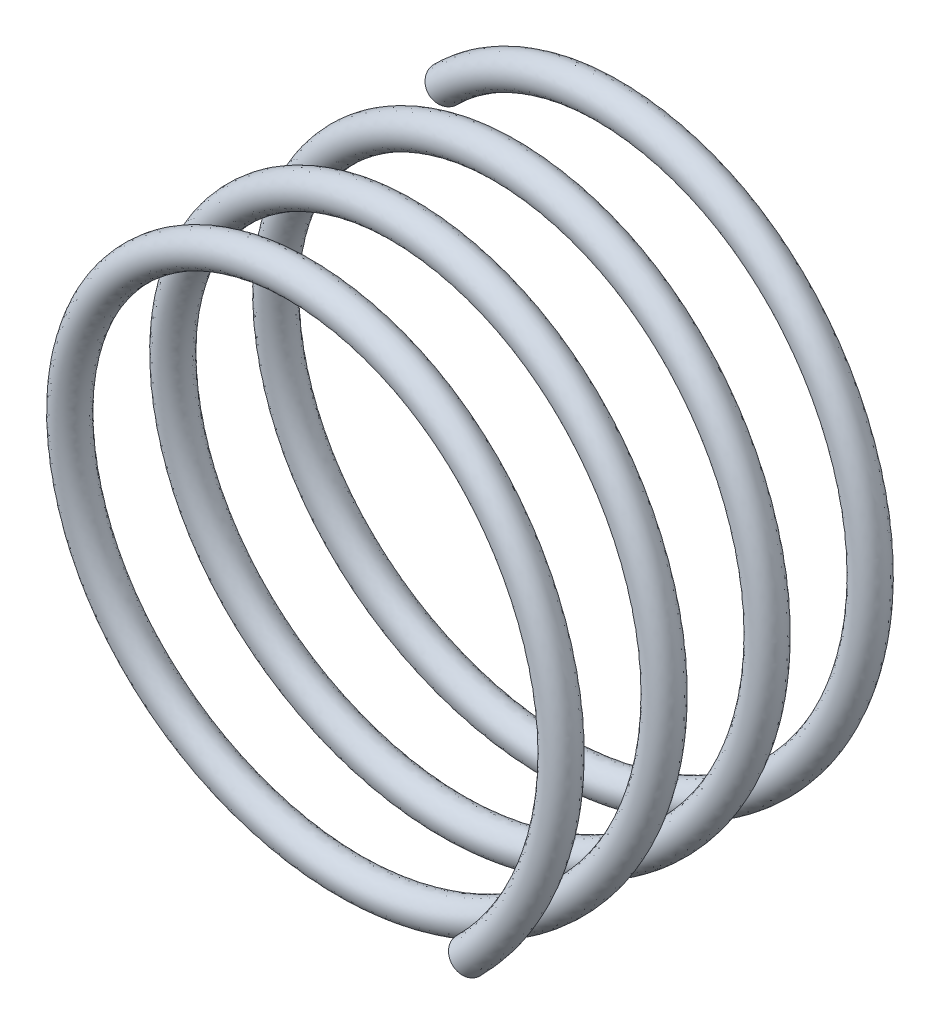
ISO-10303-21;
HEADER;
FILE_DESCRIPTION(('STEP AP214'),'2;1');
FILE_NAME('part.step','',(''),(''),'','','');
FILE_SCHEMA(('AUTOMOTIVE_DESIGN { 1 0 10303 214 1 1 1 1 }'));
ENDSEC;
DATA;
#1=APPLICATION_CONTEXT('core data for automotive mechanical design processes');
#2=APPLICATION_PROTOCOL_DEFINITION('international standard','automotive_design',2000,#1);
#3=PRODUCT_CONTEXT('',#1,'mechanical');
#4=PRODUCT('Part','Part','',(#3));
#5=PRODUCT_RELATED_PRODUCT_CATEGORY('part','',(#4));
#6=PRODUCT_DEFINITION_FORMATION('','',#4);
#7=PRODUCT_DEFINITION_CONTEXT('part definition',#1,'design');
#8=PRODUCT_DEFINITION('design','',#6,#7);
#9=PRODUCT_DEFINITION_SHAPE('','',#8);
#10=(LENGTH_UNIT() NAMED_UNIT(*) SI_UNIT(.MILLI.,.METRE.));
#11=(NAMED_UNIT(*) PLANE_ANGLE_UNIT() SI_UNIT($,.RADIAN.));
#12=(NAMED_UNIT(*) SI_UNIT($,.STERADIAN.) SOLID_ANGLE_UNIT());
#13=UNCERTAINTY_MEASURE_WITH_UNIT(LENGTH_MEASURE(1.E-05),#10,'distance_accuracy_value','');
#14=(GEOMETRIC_REPRESENTATION_CONTEXT(3) GLOBAL_UNCERTAINTY_ASSIGNED_CONTEXT((#13)) GLOBAL_UNIT_ASSIGNED_CONTEXT((#10,
#11,#12)) REPRESENTATION_CONTEXT('',''));
#15=CARTESIAN_POINT('',(0.,0.,0.));
#16=DIRECTION('',(0.,0.,1.));
#17=DIRECTION('',(1.,0.,0.));
#18=AXIS2_PLACEMENT_3D('',#15,#16,#17);
#19=CARTESIAN_POINT('',(2.32288080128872,-2.32310555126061,4.37240380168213));
#20=DIRECTION('',(-0.705785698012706,-0.705785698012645,0.061099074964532));
#21=DIRECTION('',(0.707106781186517,-0.707106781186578,0.));
#22=AXIS2_PLACEMENT_3D('',#19,#20,#21);
#23=PLANE('',#22);
#24=CARTESIAN_POINT('',(2.32288080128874,-2.32310555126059,4.37240380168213));
#25=DIRECTION('',(-0.7057856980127,-0.705785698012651,0.061099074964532));
#26=DIRECTION('',(0.707106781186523,-0.707106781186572,0.));
#27=AXIS2_PLACEMENT_3D('',#24,#25,#26);
#28=CIRCLE('',#27,0.2);
#29=CARTESIAN_POINT('',(2.46430215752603,-2.46452690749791,4.37240380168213));
#30=VERTEX_POINT('',#29);
#31=EDGE_CURVE('E36',#30,#30,#28,.T.);
#32=ORIENTED_EDGE('',*,*,#31,.T.);
#33=EDGE_LOOP('',(#32));
#34=FACE_BOUND('',#33,.T.);
#35=ADVANCED_FACE('F26',(#34),#23,.T.);
#36=CARTESIAN_POINT('',(-2.32288080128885,2.32310555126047,-0.00259619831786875));
#37=DIRECTION('',(0.705785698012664,0.705785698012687,0.061099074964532));
#38=DIRECTION('',(-0.707106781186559,0.707106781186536,0.));
#39=AXIS2_PLACEMENT_3D('',#36,#37,#38);
#40=PLANE('',#39);
#41=CARTESIAN_POINT('',(-2.32288080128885,2.32310555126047,-0.00259619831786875));
#42=DIRECTION('',(0.705785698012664,0.705785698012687,0.061099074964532));
#43=DIRECTION('',(-0.707106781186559,0.707106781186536,0.));
#44=AXIS2_PLACEMENT_3D('',#41,#42,#43);
#45=CIRCLE('',#44,0.2);
#46=CARTESIAN_POINT('',(-2.46430215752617,2.46452690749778,-0.00259619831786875));
#47=VERTEX_POINT('',#46);
#48=EDGE_CURVE('E11',#47,#47,#45,.T.);
#49=ORIENTED_EDGE('',*,*,#48,.F.);
#50=EDGE_LOOP('',(#49));
#51=FACE_BOUND('',#50,.T.);
#52=ADVANCED_FACE('F44',(#51),#40,.F.);
#53=CARTESIAN_POINT('',(2.46430215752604,-2.4645269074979,4.37240380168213));
#54=CARTESIAN_POINT('',(3.88719743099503,-1.04176139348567,4.26823713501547));
#55=CARTESIAN_POINT('',(3.3664939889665,0.901884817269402,4.1640704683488));
#56=CARTESIAN_POINT('',(2.84579054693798,2.84553102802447,4.05990380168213));
#57=CARTESIAN_POINT('',(0.902191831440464,3.3664117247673,3.95573713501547));
#58=CARTESIAN_POINT('',(-1.04140688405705,3.88729242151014,3.8515704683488));
#59=CARTESIAN_POINT('',(-2.46430215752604,2.4645269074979,3.74740380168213));
#60=CARTESIAN_POINT('',(-3.88719743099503,1.04176139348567,3.64323713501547));
#61=CARTESIAN_POINT('',(-3.3664939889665,-0.901884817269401,3.5390704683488));
#62=CARTESIAN_POINT('',(-2.84579054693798,-2.84553102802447,3.43490380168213));
#63=CARTESIAN_POINT('',(-0.902191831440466,-3.3664117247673,3.33073713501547));
#64=CARTESIAN_POINT('',(1.04140688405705,-3.88729242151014,3.2265704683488));
#65=CARTESIAN_POINT('',(2.46430215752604,-2.4645269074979,3.12240380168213));
#66=CARTESIAN_POINT('',(3.88719743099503,-1.04176139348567,3.01823713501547));
#67=CARTESIAN_POINT('',(3.3664939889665,0.901884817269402,2.9140704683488));
#68=CARTESIAN_POINT('',(2.84579054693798,2.84553102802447,2.80990380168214));
#69=CARTESIAN_POINT('',(0.902191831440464,3.3664117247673,2.70573713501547));
#70=CARTESIAN_POINT('',(-1.04140688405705,3.88729242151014,2.6015704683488));
#71=CARTESIAN_POINT('',(-2.46430215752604,2.4645269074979,2.49740380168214));
#72=CARTESIAN_POINT('',(-3.88719743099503,1.04176139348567,2.39323713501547));
#73=CARTESIAN_POINT('',(-3.3664939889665,-0.901884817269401,2.2890704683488));
#74=CARTESIAN_POINT('',(-2.84579054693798,-2.84553102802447,2.18490380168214));
#75=CARTESIAN_POINT('',(-0.902191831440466,-3.3664117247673,2.08073713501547));
#76=CARTESIAN_POINT('',(1.04140688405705,-3.88729242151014,1.9765704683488));
#77=CARTESIAN_POINT('',(2.46430215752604,-2.4645269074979,1.87240380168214));
#78=CARTESIAN_POINT('',(3.88719743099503,-1.04176139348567,1.76823713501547));
#79=CARTESIAN_POINT('',(3.3664939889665,0.901884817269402,1.6640704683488));
#80=CARTESIAN_POINT('',(2.84579054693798,2.84553102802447,1.55990380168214));
#81=CARTESIAN_POINT('',(0.902191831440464,3.3664117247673,1.45573713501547));
#82=CARTESIAN_POINT('',(-1.04140688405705,3.88729242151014,1.35157046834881));
#83=CARTESIAN_POINT('',(-2.46430215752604,2.4645269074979,1.24740380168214));
#84=CARTESIAN_POINT('',(-3.88719743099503,1.04176139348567,1.14323713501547));
#85=CARTESIAN_POINT('',(-3.3664939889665,-0.901884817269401,1.03907046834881));
#86=CARTESIAN_POINT('',(-2.84579054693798,-2.84553102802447,0.934903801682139));
#87=CARTESIAN_POINT('',(-0.902191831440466,-3.3664117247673,0.830737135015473));
#88=CARTESIAN_POINT('',(1.04140688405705,-3.88729242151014,0.726570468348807));
#89=CARTESIAN_POINT('',(2.46430215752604,-2.4645269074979,0.62240380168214));
#90=CARTESIAN_POINT('',(3.88719743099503,-1.04176139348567,0.518237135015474));
#91=CARTESIAN_POINT('',(3.3664939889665,0.901884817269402,0.414070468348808));
#92=CARTESIAN_POINT('',(2.84579054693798,2.84553102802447,0.309903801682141));
#93=CARTESIAN_POINT('',(0.902191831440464,3.3664117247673,0.205737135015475));
#94=CARTESIAN_POINT('',(-1.04140688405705,3.88729242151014,0.101570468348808));
#95=CARTESIAN_POINT('',(-2.46430215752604,2.4645269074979,-0.00259619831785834));
#96=CARTESIAN_POINT('',(-3.88719743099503,1.04176139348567,-0.106762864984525));
#97=CARTESIAN_POINT('',(-3.3664939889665,-0.901884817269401,-0.210929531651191));
#98=CARTESIAN_POINT('',(-2.84579054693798,-2.84553102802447,-0.315096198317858));
#99=CARTESIAN_POINT('',(-0.902191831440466,-3.3664117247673,-0.419262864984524));
#100=CARTESIAN_POINT('',(1.04140688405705,-3.88729242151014,-0.523429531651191));
#101=CARTESIAN_POINT('',(2.46430215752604,-2.4645269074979,-0.627596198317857));
#102=CARTESIAN_POINT('',(2.4815835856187,-2.44724547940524,4.77165648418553));
#103=CARTESIAN_POINT('',(3.89450142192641,-1.01450252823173,4.66748981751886));
#104=CARTESIAN_POINT('',(3.36016854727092,0.925491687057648,4.56332315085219));
#105=CARTESIAN_POINT('',(2.82583567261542,2.86548590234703,4.45915648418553));
#106=CARTESIAN_POINT('',(0.878584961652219,3.37273716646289,4.35498981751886));
#107=CARTESIAN_POINT('',(-1.06866574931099,3.87998843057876,4.25082315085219));
#108=CARTESIAN_POINT('',(-2.4815835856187,2.44724547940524,4.14665648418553));
#109=CARTESIAN_POINT('',(-3.89450142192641,1.01450252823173,4.04248981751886));
#110=CARTESIAN_POINT('',(-3.36016854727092,-0.925491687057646,3.93832315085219));
#111=CARTESIAN_POINT('',(-2.82583567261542,-2.86548590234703,3.83415648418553));
#112=CARTESIAN_POINT('',(-0.878584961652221,-3.37273716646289,3.72998981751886));
#113=CARTESIAN_POINT('',(1.06866574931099,-3.87998843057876,3.6258231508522));
#114=CARTESIAN_POINT('',(2.4815835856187,-2.44724547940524,3.52165648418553));
#115=CARTESIAN_POINT('',(3.89450142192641,-1.01450252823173,3.41748981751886));
#116=CARTESIAN_POINT('',(3.36016854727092,0.925491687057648,3.3133231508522));
#117=CARTESIAN_POINT('',(2.82583567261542,2.86548590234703,3.20915648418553));
#118=CARTESIAN_POINT('',(0.878584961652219,3.37273716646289,3.10498981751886));
#119=CARTESIAN_POINT('',(-1.06866574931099,3.87998843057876,3.0008231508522));
#120=CARTESIAN_POINT('',(-2.4815835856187,2.44724547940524,2.89665648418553));
#121=CARTESIAN_POINT('',(-3.89450142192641,1.01450252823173,2.79248981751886));
#122=CARTESIAN_POINT('',(-3.36016854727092,-0.925491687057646,2.6883231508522));
#123=CARTESIAN_POINT('',(-2.82583567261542,-2.86548590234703,2.58415648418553));
#124=CARTESIAN_POINT('',(-0.878584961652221,-3.37273716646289,2.47998981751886));
#125=CARTESIAN_POINT('',(1.06866574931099,-3.87998843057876,2.3758231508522));
#126=CARTESIAN_POINT('',(2.4815835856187,-2.44724547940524,2.27165648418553));
#127=CARTESIAN_POINT('',(3.89450142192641,-1.01450252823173,2.16748981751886));
#128=CARTESIAN_POINT('',(3.36016854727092,0.925491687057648,2.0633231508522));
#129=CARTESIAN_POINT('',(2.82583567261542,2.86548590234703,1.95915648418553));
#130=CARTESIAN_POINT('',(0.878584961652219,3.37273716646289,1.85498981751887));
#131=CARTESIAN_POINT('',(-1.06866574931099,3.87998843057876,1.7508231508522));
#132=CARTESIAN_POINT('',(-2.4815835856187,2.44724547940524,1.64665648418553));
#133=CARTESIAN_POINT('',(-3.89450142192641,1.01450252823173,1.54248981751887));
#134=CARTESIAN_POINT('',(-3.36016854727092,-0.925491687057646,1.4383231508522));
#135=CARTESIAN_POINT('',(-2.82583567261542,-2.86548590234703,1.33415648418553));
#136=CARTESIAN_POINT('',(-0.878584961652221,-3.37273716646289,1.22998981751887));
#137=CARTESIAN_POINT('',(1.06866574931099,-3.87998843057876,1.1258231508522));
#138=CARTESIAN_POINT('',(2.4815835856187,-2.44724547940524,1.02165648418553));
#139=CARTESIAN_POINT('',(3.89450142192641,-1.01450252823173,0.917489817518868));
#140=CARTESIAN_POINT('',(3.36016854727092,0.925491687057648,0.813323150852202));
#141=CARTESIAN_POINT('',(2.82583567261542,2.86548590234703,0.709156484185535));
#142=CARTESIAN_POINT('',(0.878584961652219,3.37273716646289,0.604989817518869));
#143=CARTESIAN_POINT('',(-1.06866574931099,3.87998843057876,0.500823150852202));
#144=CARTESIAN_POINT('',(-2.4815835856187,2.44724547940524,0.396656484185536));
#145=CARTESIAN_POINT('',(-3.89450142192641,1.01450252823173,0.292489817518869));
#146=CARTESIAN_POINT('',(-3.36016854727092,-0.925491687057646,0.188323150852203));
#147=CARTESIAN_POINT('',(-2.82583567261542,-2.86548590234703,0.0841564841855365));
#148=CARTESIAN_POINT('',(-0.878584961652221,-3.37273716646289,-0.02001018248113));
#149=CARTESIAN_POINT('',(1.06866574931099,-3.87998843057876,-0.124176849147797));
#150=CARTESIAN_POINT('',(2.4815835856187,-2.44724547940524,-0.228343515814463));
#151=CARTESIAN_POINT('',(2.19874087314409,-2.16440276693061,4.77165648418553));
#152=CARTESIAN_POINT('',(3.44835939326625,-0.894959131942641,4.66748981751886));
#153=CARTESIAN_POINT('',(2.97379821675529,0.821964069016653,4.56332315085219));
#154=CARTESIAN_POINT('',(2.49923704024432,2.53888726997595,4.45915648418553));
#155=CARTESIAN_POINT('',(0.775057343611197,2.98636683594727,4.35498981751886));
#156=CARTESIAN_POINT('',(-0.949122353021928,3.43384640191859,4.25082315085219));
#157=CARTESIAN_POINT('',(-2.19874087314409,2.16440276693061,4.14665648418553));
#158=CARTESIAN_POINT('',(-3.44835939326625,0.894959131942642,4.04248981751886));
#159=CARTESIAN_POINT('',(-2.97379821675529,-0.821964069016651,3.93832315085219));
#160=CARTESIAN_POINT('',(-2.49923704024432,-2.53888726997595,3.83415648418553));
#161=CARTESIAN_POINT('',(-0.775057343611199,-2.98636683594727,3.72998981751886));
#162=CARTESIAN_POINT('',(0.949122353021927,-3.43384640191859,3.6258231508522));
#163=CARTESIAN_POINT('',(2.19874087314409,-2.16440276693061,3.52165648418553));
#164=CARTESIAN_POINT('',(3.44835939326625,-0.894959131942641,3.41748981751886));
#165=CARTESIAN_POINT('',(2.97379821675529,0.821964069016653,3.3133231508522));
#166=CARTESIAN_POINT('',(2.49923704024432,2.53888726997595,3.20915648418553));
#167=CARTESIAN_POINT('',(0.775057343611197,2.98636683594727,3.10498981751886));
#168=CARTESIAN_POINT('',(-0.949122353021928,3.43384640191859,3.0008231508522));
#169=CARTESIAN_POINT('',(-2.19874087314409,2.16440276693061,2.89665648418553));
#170=CARTESIAN_POINT('',(-3.44835939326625,0.894959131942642,2.79248981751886));
#171=CARTESIAN_POINT('',(-2.97379821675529,-0.821964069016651,2.6883231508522));
#172=CARTESIAN_POINT('',(-2.49923704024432,-2.53888726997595,2.58415648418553));
#173=CARTESIAN_POINT('',(-0.775057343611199,-2.98636683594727,2.47998981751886));
#174=CARTESIAN_POINT('',(0.949122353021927,-3.43384640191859,2.3758231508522));
#175=CARTESIAN_POINT('',(2.19874087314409,-2.16440276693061,2.27165648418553));
#176=CARTESIAN_POINT('',(3.44835939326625,-0.894959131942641,2.16748981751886));
#177=CARTESIAN_POINT('',(2.97379821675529,0.821964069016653,2.0633231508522));
#178=CARTESIAN_POINT('',(2.49923704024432,2.53888726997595,1.95915648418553));
#179=CARTESIAN_POINT('',(0.775057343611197,2.98636683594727,1.85498981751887));
#180=CARTESIAN_POINT('',(-0.949122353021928,3.43384640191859,1.7508231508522));
#181=CARTESIAN_POINT('',(-2.19874087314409,2.16440276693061,1.64665648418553));
#182=CARTESIAN_POINT('',(-3.44835939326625,0.894959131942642,1.54248981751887));
#183=CARTESIAN_POINT('',(-2.97379821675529,-0.821964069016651,1.4383231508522));
#184=CARTESIAN_POINT('',(-2.49923704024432,-2.53888726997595,1.33415648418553));
#185=CARTESIAN_POINT('',(-0.775057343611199,-2.98636683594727,1.22998981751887));
#186=CARTESIAN_POINT('',(0.949122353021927,-3.43384640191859,1.1258231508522));
#187=CARTESIAN_POINT('',(2.19874087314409,-2.16440276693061,1.02165648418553));
#188=CARTESIAN_POINT('',(3.44835939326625,-0.894959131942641,0.917489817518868));
#189=CARTESIAN_POINT('',(2.97379821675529,0.821964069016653,0.813323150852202));
#190=CARTESIAN_POINT('',(2.49923704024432,2.53888726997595,0.709156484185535));
#191=CARTESIAN_POINT('',(0.775057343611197,2.98636683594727,0.604989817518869));
#192=CARTESIAN_POINT('',(-0.949122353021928,3.43384640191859,0.500823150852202));
#193=CARTESIAN_POINT('',(-2.19874087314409,2.16440276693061,0.396656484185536));
#194=CARTESIAN_POINT('',(-3.44835939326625,0.894959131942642,0.292489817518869));
#195=CARTESIAN_POINT('',(-2.97379821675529,-0.821964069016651,0.188323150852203));
#196=CARTESIAN_POINT('',(-2.49923704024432,-2.53888726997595,0.0841564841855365));
#197=CARTESIAN_POINT('',(-0.775057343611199,-2.98636683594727,-0.02001018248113));
#198=CARTESIAN_POINT('',(0.949122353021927,-3.43384640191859,-0.124176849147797));
#199=CARTESIAN_POINT('',(2.19874087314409,-2.16440276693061,-0.228343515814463));
#200=CARTESIAN_POINT('',(2.18145944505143,-2.18168419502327,4.37240380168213));
#201=CARTESIAN_POINT('',(3.44105540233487,-0.922217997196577,4.26823713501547));
#202=CARTESIAN_POINT('',(2.98012365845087,0.798357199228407,4.1640704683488));
#203=CARTESIAN_POINT('',(2.51919191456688,2.51893239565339,4.05990380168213));
#204=CARTESIAN_POINT('',(0.798664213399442,2.98004139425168,3.95573713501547));
#205=CARTESIAN_POINT('',(-0.921863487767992,3.44115039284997,3.8515704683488));
#206=CARTESIAN_POINT('',(-2.18145944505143,2.18168419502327,3.74740380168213));
#207=CARTESIAN_POINT('',(-3.44105540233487,0.922217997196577,3.64323713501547));
#208=CARTESIAN_POINT('',(-2.98012365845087,-0.798357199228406,3.5390704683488));
#209=CARTESIAN_POINT('',(-2.51919191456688,-2.51893239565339,3.43490380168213));
#210=CARTESIAN_POINT('',(-0.798664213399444,-2.98004139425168,3.33073713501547));
#211=CARTESIAN_POINT('',(0.921863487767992,-3.44115039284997,3.2265704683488));
#212=CARTESIAN_POINT('',(2.18145944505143,-2.18168419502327,3.12240380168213));
#213=CARTESIAN_POINT('',(3.44105540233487,-0.922217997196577,3.01823713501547));
#214=CARTESIAN_POINT('',(2.98012365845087,0.798357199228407,2.9140704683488));
#215=CARTESIAN_POINT('',(2.51919191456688,2.51893239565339,2.80990380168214));
#216=CARTESIAN_POINT('',(0.798664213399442,2.98004139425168,2.70573713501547));
#217=CARTESIAN_POINT('',(-0.921863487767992,3.44115039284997,2.6015704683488));
#218=CARTESIAN_POINT('',(-2.18145944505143,2.18168419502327,2.49740380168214));
#219=CARTESIAN_POINT('',(-3.44105540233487,0.922217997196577,2.39323713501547));
#220=CARTESIAN_POINT('',(-2.98012365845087,-0.798357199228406,2.2890704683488));
#221=CARTESIAN_POINT('',(-2.51919191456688,-2.51893239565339,2.18490380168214));
#222=CARTESIAN_POINT('',(-0.798664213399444,-2.98004139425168,2.08073713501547));
#223=CARTESIAN_POINT('',(0.921863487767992,-3.44115039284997,1.9765704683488));
#224=CARTESIAN_POINT('',(2.18145944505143,-2.18168419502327,1.87240380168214));
#225=CARTESIAN_POINT('',(3.44105540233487,-0.922217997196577,1.76823713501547));
#226=CARTESIAN_POINT('',(2.98012365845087,0.798357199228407,1.6640704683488));
#227=CARTESIAN_POINT('',(2.51919191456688,2.51893239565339,1.55990380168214));
#228=CARTESIAN_POINT('',(0.798664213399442,2.98004139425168,1.45573713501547));
#229=CARTESIAN_POINT('',(-0.921863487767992,3.44115039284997,1.35157046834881));
#230=CARTESIAN_POINT('',(-2.18145944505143,2.18168419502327,1.24740380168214));
#231=CARTESIAN_POINT('',(-3.44105540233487,0.922217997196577,1.14323713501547));
#232=CARTESIAN_POINT('',(-2.98012365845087,-0.798357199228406,1.03907046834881));
#233=CARTESIAN_POINT('',(-2.51919191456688,-2.51893239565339,0.934903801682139));
#234=CARTESIAN_POINT('',(-0.798664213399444,-2.98004139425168,0.830737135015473));
#235=CARTESIAN_POINT('',(0.921863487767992,-3.44115039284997,0.726570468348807));
#236=CARTESIAN_POINT('',(2.18145944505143,-2.18168419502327,0.62240380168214));
#237=CARTESIAN_POINT('',(3.44105540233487,-0.922217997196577,0.518237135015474));
#238=CARTESIAN_POINT('',(2.98012365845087,0.798357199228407,0.414070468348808));
#239=CARTESIAN_POINT('',(2.51919191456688,2.51893239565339,0.309903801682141));
#240=CARTESIAN_POINT('',(0.798664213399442,2.98004139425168,0.205737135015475));
#241=CARTESIAN_POINT('',(-0.921863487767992,3.44115039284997,0.101570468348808));
#242=CARTESIAN_POINT('',(-2.18145944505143,2.18168419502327,-0.00259619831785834));
#243=CARTESIAN_POINT('',(-3.44105540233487,0.922217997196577,-0.106762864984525));
#244=CARTESIAN_POINT('',(-2.98012365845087,-0.798357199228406,-0.210929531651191));
#245=CARTESIAN_POINT('',(-2.51919191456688,-2.51893239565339,-0.315096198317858));
#246=CARTESIAN_POINT('',(-0.798664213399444,-2.98004139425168,-0.419262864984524));
#247=CARTESIAN_POINT('',(0.921863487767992,-3.44115039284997,-0.523429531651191));
#248=CARTESIAN_POINT('',(2.18145944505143,-2.18168419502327,-0.627596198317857));
#249=CARTESIAN_POINT('',(2.16417801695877,-2.19896562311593,3.97315111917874));
#250=CARTESIAN_POINT('',(3.43375141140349,-0.949476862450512,3.86898445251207));
#251=CARTESIAN_POINT('',(2.98644910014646,0.774750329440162,3.76481778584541));
#252=CARTESIAN_POINT('',(2.53914678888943,2.49897752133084,3.66065111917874));
#253=CARTESIAN_POINT('',(0.822271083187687,2.97371595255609,3.55648445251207));
#254=CARTESIAN_POINT('',(-0.894604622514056,3.44845438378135,3.45231778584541));
#255=CARTESIAN_POINT('',(-2.16417801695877,2.19896562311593,3.34815111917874));
#256=CARTESIAN_POINT('',(-3.43375141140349,0.949476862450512,3.24398445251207));
#257=CARTESIAN_POINT('',(-2.98644910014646,-0.774750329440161,3.13981778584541));
#258=CARTESIAN_POINT('',(-2.53914678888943,-2.49897752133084,3.03565111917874));
#259=CARTESIAN_POINT('',(-0.822271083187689,-2.97371595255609,2.93148445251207));
#260=CARTESIAN_POINT('',(0.894604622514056,-3.44845438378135,2.82731778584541));
#261=CARTESIAN_POINT('',(2.16417801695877,-2.19896562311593,2.72315111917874));
#262=CARTESIAN_POINT('',(3.43375141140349,-0.949476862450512,2.61898445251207));
#263=CARTESIAN_POINT('',(2.98644910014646,0.774750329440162,2.51481778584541));
#264=CARTESIAN_POINT('',(2.53914678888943,2.49897752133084,2.41065111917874));
#265=CARTESIAN_POINT('',(0.822271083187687,2.97371595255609,2.30648445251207));
#266=CARTESIAN_POINT('',(-0.894604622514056,3.44845438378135,2.20231778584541));
#267=CARTESIAN_POINT('',(-2.16417801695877,2.19896562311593,2.09815111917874));
#268=CARTESIAN_POINT('',(-3.43375141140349,0.949476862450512,1.99398445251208));
#269=CARTESIAN_POINT('',(-2.98644910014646,-0.774750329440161,1.88981778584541));
#270=CARTESIAN_POINT('',(-2.53914678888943,-2.49897752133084,1.78565111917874));
#271=CARTESIAN_POINT('',(-0.822271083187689,-2.97371595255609,1.68148445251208));
#272=CARTESIAN_POINT('',(0.894604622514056,-3.44845438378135,1.57731778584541));
#273=CARTESIAN_POINT('',(2.16417801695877,-2.19896562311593,1.47315111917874));
#274=CARTESIAN_POINT('',(3.43375141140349,-0.949476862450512,1.36898445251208));
#275=CARTESIAN_POINT('',(2.98644910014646,0.774750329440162,1.26481778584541));
#276=CARTESIAN_POINT('',(2.53914678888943,2.49897752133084,1.16065111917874));
#277=CARTESIAN_POINT('',(0.822271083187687,2.97371595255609,1.05648445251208));
#278=CARTESIAN_POINT('',(-0.894604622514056,3.44845438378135,0.952317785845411));
#279=CARTESIAN_POINT('',(-2.16417801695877,2.19896562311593,0.848151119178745));
#280=CARTESIAN_POINT('',(-3.43375141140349,0.949476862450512,0.743984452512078));
#281=CARTESIAN_POINT('',(-2.98644910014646,-0.774750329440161,0.639817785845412));
#282=CARTESIAN_POINT('',(-2.53914678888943,-2.49897752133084,0.535651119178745));
#283=CARTESIAN_POINT('',(-0.822271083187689,-2.97371595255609,0.431484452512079));
#284=CARTESIAN_POINT('',(0.894604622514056,-3.44845438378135,0.327317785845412));
#285=CARTESIAN_POINT('',(2.16417801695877,-2.19896562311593,0.223151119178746));
#286=CARTESIAN_POINT('',(3.43375141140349,-0.949476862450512,0.118984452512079));
#287=CARTESIAN_POINT('',(2.98644910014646,0.774750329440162,0.0148177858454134));
#288=CARTESIAN_POINT('',(2.53914678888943,2.49897752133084,-0.0893488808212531));
#289=CARTESIAN_POINT('',(0.822271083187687,2.97371595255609,-0.19351554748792));
#290=CARTESIAN_POINT('',(-0.894604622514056,3.44845438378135,-0.297682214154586));
#291=CARTESIAN_POINT('',(-2.16417801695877,2.19896562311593,-0.401848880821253));
#292=CARTESIAN_POINT('',(-3.43375141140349,0.949476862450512,-0.506015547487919));
#293=CARTESIAN_POINT('',(-2.98644910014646,-0.774750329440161,-0.610182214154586));
#294=CARTESIAN_POINT('',(-2.53914678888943,-2.49897752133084,-0.714348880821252));
#295=CARTESIAN_POINT('',(-0.822271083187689,-2.97371595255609,-0.818515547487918));
#296=CARTESIAN_POINT('',(0.894604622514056,-3.44845438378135,-0.922682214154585));
#297=CARTESIAN_POINT('',(2.16417801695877,-2.19896562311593,-1.02684888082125));
#298=CARTESIAN_POINT('',(2.44702072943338,-2.48180833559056,3.97315111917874));
#299=CARTESIAN_POINT('',(3.87989344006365,-1.0690202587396,3.86898445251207));
#300=CARTESIAN_POINT('',(3.37281943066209,0.878277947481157,3.76481778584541));
#301=CARTESIAN_POINT('',(2.86574542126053,2.82557615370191,3.66065111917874));
#302=CARTESIAN_POINT('',(0.925798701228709,3.36008628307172,3.55648445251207));
#303=CARTESIAN_POINT('',(-1.01414801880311,3.89459641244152,3.45231778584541));
#304=CARTESIAN_POINT('',(-2.44702072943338,2.48180833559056,3.34815111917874));
#305=CARTESIAN_POINT('',(-3.87989344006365,1.0690202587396,3.24398445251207));
#306=CARTESIAN_POINT('',(-3.37281943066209,-0.878277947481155,3.13981778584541));
#307=CARTESIAN_POINT('',(-2.86574542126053,-2.82557615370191,3.03565111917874));
#308=CARTESIAN_POINT('',(-0.925798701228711,-3.36008628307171,2.93148445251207));
#309=CARTESIAN_POINT('',(1.01414801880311,-3.89459641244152,2.82731778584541));
#310=CARTESIAN_POINT('',(2.44702072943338,-2.48180833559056,2.72315111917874));
#311=CARTESIAN_POINT('',(3.87989344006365,-1.0690202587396,2.61898445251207));
#312=CARTESIAN_POINT('',(3.37281943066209,0.878277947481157,2.51481778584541));
#313=CARTESIAN_POINT('',(2.86574542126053,2.82557615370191,2.41065111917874));
#314=CARTESIAN_POINT('',(0.925798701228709,3.36008628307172,2.30648445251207));
#315=CARTESIAN_POINT('',(-1.01414801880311,3.89459641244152,2.20231778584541));
#316=CARTESIAN_POINT('',(-2.44702072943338,2.48180833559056,2.09815111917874));
#317=CARTESIAN_POINT('',(-3.87989344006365,1.0690202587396,1.99398445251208));
#318=CARTESIAN_POINT('',(-3.37281943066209,-0.878277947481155,1.88981778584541));
#319=CARTESIAN_POINT('',(-2.86574542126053,-2.82557615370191,1.78565111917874));
#320=CARTESIAN_POINT('',(-0.925798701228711,-3.36008628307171,1.68148445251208));
#321=CARTESIAN_POINT('',(1.01414801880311,-3.89459641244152,1.57731778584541));
#322=CARTESIAN_POINT('',(2.44702072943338,-2.48180833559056,1.47315111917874));
#323=CARTESIAN_POINT('',(3.87989344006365,-1.0690202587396,1.36898445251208));
#324=CARTESIAN_POINT('',(3.37281943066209,0.878277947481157,1.26481778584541));
#325=CARTESIAN_POINT('',(2.86574542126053,2.82557615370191,1.16065111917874));
#326=CARTESIAN_POINT('',(0.925798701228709,3.36008628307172,1.05648445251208));
#327=CARTESIAN_POINT('',(-1.01414801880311,3.89459641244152,0.952317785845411));
#328=CARTESIAN_POINT('',(-2.44702072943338,2.48180833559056,0.848151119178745));
#329=CARTESIAN_POINT('',(-3.87989344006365,1.0690202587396,0.743984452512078));
#330=CARTESIAN_POINT('',(-3.37281943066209,-0.878277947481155,0.639817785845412));
#331=CARTESIAN_POINT('',(-2.86574542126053,-2.82557615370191,0.535651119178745));
#332=CARTESIAN_POINT('',(-0.925798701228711,-3.36008628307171,0.431484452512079));
#333=CARTESIAN_POINT('',(1.01414801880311,-3.89459641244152,0.327317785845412));
#334=CARTESIAN_POINT('',(2.44702072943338,-2.48180833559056,0.223151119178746));
#335=CARTESIAN_POINT('',(3.87989344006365,-1.0690202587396,0.118984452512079));
#336=CARTESIAN_POINT('',(3.37281943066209,0.878277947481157,0.0148177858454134));
#337=CARTESIAN_POINT('',(2.86574542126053,2.82557615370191,-0.0893488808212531));
#338=CARTESIAN_POINT('',(0.925798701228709,3.36008628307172,-0.19351554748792));
#339=CARTESIAN_POINT('',(-1.01414801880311,3.89459641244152,-0.297682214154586));
#340=CARTESIAN_POINT('',(-2.44702072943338,2.48180833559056,-0.401848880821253));
#341=CARTESIAN_POINT('',(-3.87989344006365,1.0690202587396,-0.506015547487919));
#342=CARTESIAN_POINT('',(-3.37281943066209,-0.878277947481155,-0.610182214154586));
#343=CARTESIAN_POINT('',(-2.86574542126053,-2.82557615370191,-0.714348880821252));
#344=CARTESIAN_POINT('',(-0.925798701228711,-3.36008628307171,-0.818515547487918));
#345=CARTESIAN_POINT('',(1.01414801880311,-3.89459641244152,-0.922682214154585));
#346=CARTESIAN_POINT('',(2.44702072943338,-2.48180833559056,-1.02684888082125));
#347=CARTESIAN_POINT('',(2.46430215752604,-2.4645269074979,4.37240380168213));
#348=CARTESIAN_POINT('',(3.88719743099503,-1.04176139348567,4.26823713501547));
#349=CARTESIAN_POINT('',(3.3664939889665,0.901884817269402,4.1640704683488));
#350=CARTESIAN_POINT('',(2.84579054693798,2.84553102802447,4.05990380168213));
#351=CARTESIAN_POINT('',(0.902191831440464,3.3664117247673,3.95573713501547));
#352=CARTESIAN_POINT('',(-1.04140688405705,3.88729242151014,3.8515704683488));
#353=CARTESIAN_POINT('',(-2.46430215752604,2.4645269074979,3.74740380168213));
#354=CARTESIAN_POINT('',(-3.88719743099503,1.04176139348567,3.64323713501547));
#355=CARTESIAN_POINT('',(-3.3664939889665,-0.901884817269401,3.5390704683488));
#356=CARTESIAN_POINT('',(-2.84579054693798,-2.84553102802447,3.43490380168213));
#357=CARTESIAN_POINT('',(-0.902191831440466,-3.3664117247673,3.33073713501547));
#358=CARTESIAN_POINT('',(1.04140688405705,-3.88729242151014,3.2265704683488));
#359=CARTESIAN_POINT('',(2.46430215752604,-2.4645269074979,3.12240380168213));
#360=CARTESIAN_POINT('',(3.88719743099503,-1.04176139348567,3.01823713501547));
#361=CARTESIAN_POINT('',(3.3664939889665,0.901884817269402,2.9140704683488));
#362=CARTESIAN_POINT('',(2.84579054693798,2.84553102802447,2.80990380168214));
#363=CARTESIAN_POINT('',(0.902191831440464,3.3664117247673,2.70573713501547));
#364=CARTESIAN_POINT('',(-1.04140688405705,3.88729242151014,2.6015704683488));
#365=CARTESIAN_POINT('',(-2.46430215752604,2.4645269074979,2.49740380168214));
#366=CARTESIAN_POINT('',(-3.88719743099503,1.04176139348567,2.39323713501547));
#367=CARTESIAN_POINT('',(-3.3664939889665,-0.901884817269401,2.2890704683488));
#368=CARTESIAN_POINT('',(-2.84579054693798,-2.84553102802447,2.18490380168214));
#369=CARTESIAN_POINT('',(-0.902191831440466,-3.3664117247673,2.08073713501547));
#370=CARTESIAN_POINT('',(1.04140688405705,-3.88729242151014,1.9765704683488));
#371=CARTESIAN_POINT('',(2.46430215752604,-2.4645269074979,1.87240380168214));
#372=CARTESIAN_POINT('',(3.88719743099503,-1.04176139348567,1.76823713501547));
#373=CARTESIAN_POINT('',(3.3664939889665,0.901884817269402,1.6640704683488));
#374=CARTESIAN_POINT('',(2.84579054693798,2.84553102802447,1.55990380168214));
#375=CARTESIAN_POINT('',(0.902191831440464,3.3664117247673,1.45573713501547));
#376=CARTESIAN_POINT('',(-1.04140688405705,3.88729242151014,1.35157046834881));
#377=CARTESIAN_POINT('',(-2.46430215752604,2.4645269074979,1.24740380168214));
#378=CARTESIAN_POINT('',(-3.88719743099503,1.04176139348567,1.14323713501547));
#379=CARTESIAN_POINT('',(-3.3664939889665,-0.901884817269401,1.03907046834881));
#380=CARTESIAN_POINT('',(-2.84579054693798,-2.84553102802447,0.934903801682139));
#381=CARTESIAN_POINT('',(-0.902191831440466,-3.3664117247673,0.830737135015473));
#382=CARTESIAN_POINT('',(1.04140688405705,-3.88729242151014,0.726570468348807));
#383=CARTESIAN_POINT('',(2.46430215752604,-2.4645269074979,0.62240380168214));
#384=CARTESIAN_POINT('',(3.88719743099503,-1.04176139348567,0.518237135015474));
#385=CARTESIAN_POINT('',(3.3664939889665,0.901884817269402,0.414070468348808));
#386=CARTESIAN_POINT('',(2.84579054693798,2.84553102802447,0.309903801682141));
#387=CARTESIAN_POINT('',(0.902191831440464,3.3664117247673,0.205737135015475));
#388=CARTESIAN_POINT('',(-1.04140688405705,3.88729242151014,0.101570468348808));
#389=CARTESIAN_POINT('',(-2.46430215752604,2.4645269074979,-0.00259619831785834));
#390=CARTESIAN_POINT('',(-3.88719743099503,1.04176139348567,-0.106762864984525));
#391=CARTESIAN_POINT('',(-3.3664939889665,-0.901884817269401,-0.210929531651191));
#392=CARTESIAN_POINT('',(-2.84579054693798,-2.84553102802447,-0.315096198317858));
#393=CARTESIAN_POINT('',(-0.902191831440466,-3.3664117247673,-0.419262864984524));
#394=CARTESIAN_POINT('',(1.04140688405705,-3.88729242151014,-0.523429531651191));
#395=CARTESIAN_POINT('',(2.46430215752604,-2.4645269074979,-0.627596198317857));
#396=(BOUNDED_SURFACE() B_SPLINE_SURFACE(3,2,((#53,#54,#55,#56,#57,#58,#59,#60,#61,#62,#63,#64,
#65,#66,#67,#68,#69,#70,#71,#72,#73,#74,#75,#76,#77,#78,#79,#80,#81,#82,#83,#84,#85,#86,#87,#88,
#89,#90,#91,#92,#93,#94,#95,#96,#97,#98,#99,#100,#101),(#102,#103,#104,#105,#106,#107,#108,#109,
#110,#111,#112,#113,#114,#115,#116,#117,#118,#119,#120,#121,#122,#123,#124,#125,#126,#127,#128,
#129,#130,#131,#132,#133,#134,#135,#136,#137,#138,#139,#140,#141,#142,#143,#144,#145,#146,#147,
#148,#149,#150),(#151,#152,#153,#154,#155,#156,#157,#158,#159,#160,#161,#162,#163,#164,#165,
#166,#167,#168,#169,#170,#171,#172,#173,#174,#175,#176,#177,#178,#179,#180,#181,#182,#183,#184,
#185,#186,#187,#188,#189,#190,#191,#192,#193,#194,#195,#196,#197,#198,#199),(#200,#201,#202,
#203,#204,#205,#206,#207,#208,#209,#210,#211,#212,#213,#214,#215,#216,#217,#218,#219,#220,#221,
#222,#223,#224,#225,#226,#227,#228,#229,#230,#231,#232,#233,#234,#235,#236,#237,#238,#239,#240,
#241,#242,#243,#244,#245,#246,#247,#248),(#249,#250,#251,#252,#253,#254,#255,#256,#257,#258,
#259,#260,#261,#262,#263,#264,#265,#266,#267,#268,#269,#270,#271,#272,#273,#274,#275,#276,#277,
#278,#279,#280,#281,#282,#283,#284,#285,#286,#287,#288,#289,#290,#291,#292,#293,#294,#295,#296,
#297),(#298,#299,#300,#301,#302,#303,#304,#305,#306,#307,#308,#309,#310,#311,#312,#313,#314,
#315,#316,#317,#318,#319,#320,#321,#322,#323,#324,#325,#326,#327,#328,#329,#330,#331,#332,#333,
#334,#335,#336,#337,#338,#339,#340,#341,#342,#343,#344,#345,#346),(#347,#348,#349,#350,#351,
#352,#353,#354,#355,#356,#357,#358,#359,#360,#361,#362,#363,#364,#365,#366,#367,#368,#369,#370,
#371,#372,#373,#374,#375,#376,#377,#378,#379,#380,#381,#382,#383,#384,#385,#386,#387,#388,#389,
#390,#391,#392,#393,#394,#395)),.UNSPECIFIED.,.T.,.F.,.F.) B_SPLINE_SURFACE_WITH_KNOTS((4,3,4),
(3,2,2,2,2,2,2,2,2,2,2,2,2,2,2,2,2,2,2,2,2,2,2,2,3),(0.,0.5,1.),(0.,0.0416666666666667,
0.0833333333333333,0.125,0.166666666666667,0.208333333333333,0.25,0.291666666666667,
0.333333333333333,0.375,0.416666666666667,0.458333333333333,0.5,0.541666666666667,
0.583333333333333,0.625,0.666666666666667,0.708333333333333,0.75,0.791666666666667,
0.833333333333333,0.875,0.916666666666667,0.958333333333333,1.),
.UNSPECIFIED.) GEOMETRIC_REPRESENTATION_ITEM() RATIONAL_B_SPLINE_SURFACE(((1.,0.866025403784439,
1.,0.866025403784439,1.,0.866025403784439,1.,0.866025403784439,1.,0.866025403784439,1.,
0.866025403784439,1.,0.866025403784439,1.,0.866025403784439,1.,0.866025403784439,1.,
0.866025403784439,1.,0.866025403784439,1.,0.866025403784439,1.,0.866025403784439,1.,
0.866025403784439,1.,0.866025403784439,1.,0.866025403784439,1.,0.866025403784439,1.,
0.866025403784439,1.,0.866025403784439,1.,0.866025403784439,1.,0.866025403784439,1.,
0.866025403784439,1.,0.866025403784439,1.,0.866025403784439,1.),(0.333333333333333,
0.288675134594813,0.333333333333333,0.288675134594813,0.333333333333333,0.288675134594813,
0.333333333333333,0.288675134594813,0.333333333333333,0.288675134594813,0.333333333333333,
0.288675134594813,0.333333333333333,0.288675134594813,0.333333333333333,0.288675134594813,
0.333333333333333,0.288675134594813,0.333333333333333,0.288675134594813,0.333333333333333,
0.288675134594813,0.333333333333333,0.288675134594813,0.333333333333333,0.288675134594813,
0.333333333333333,0.288675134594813,0.333333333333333,0.288675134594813,0.333333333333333,
0.288675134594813,0.333333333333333,0.288675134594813,0.333333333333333,0.288675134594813,
0.333333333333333,0.288675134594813,0.333333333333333,0.288675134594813,0.333333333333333,
0.288675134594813,0.333333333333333,0.288675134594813,0.333333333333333,0.288675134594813,
0.333333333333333,0.288675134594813,0.333333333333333),(0.333333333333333,0.288675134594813,
0.333333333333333,0.288675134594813,0.333333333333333,0.288675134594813,0.333333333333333,
0.288675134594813,0.333333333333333,0.288675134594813,0.333333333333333,0.288675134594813,
0.333333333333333,0.288675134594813,0.333333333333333,0.288675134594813,0.333333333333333,
0.288675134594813,0.333333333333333,0.288675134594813,0.333333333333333,0.288675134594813,
0.333333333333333,0.288675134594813,0.333333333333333,0.288675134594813,0.333333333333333,
0.288675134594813,0.333333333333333,0.288675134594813,0.333333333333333,0.288675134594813,
0.333333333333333,0.288675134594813,0.333333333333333,0.288675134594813,0.333333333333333,
0.288675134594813,0.333333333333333,0.288675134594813,0.333333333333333,0.288675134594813,
0.333333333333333,0.288675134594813,0.333333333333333,0.288675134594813,0.333333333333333,
0.288675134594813,0.333333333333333),(1.,0.866025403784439,1.,0.866025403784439,1.,
0.866025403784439,1.,0.866025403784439,1.,0.866025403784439,1.,0.866025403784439,1.,
0.866025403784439,1.,0.866025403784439,1.,0.866025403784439,1.,0.866025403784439,1.,
0.866025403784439,1.,0.866025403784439,1.,0.866025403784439,1.,0.866025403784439,1.,
0.866025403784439,1.,0.866025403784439,1.,0.866025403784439,1.,0.866025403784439,1.,
0.866025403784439,1.,0.866025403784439,1.,0.866025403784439,1.,0.866025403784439,1.,
0.866025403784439,1.,0.866025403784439,1.),(0.333333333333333,0.288675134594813,
0.333333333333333,0.288675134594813,0.333333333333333,0.288675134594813,0.333333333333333,
0.288675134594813,0.333333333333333,0.288675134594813,0.333333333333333,0.288675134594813,
0.333333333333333,0.288675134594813,0.333333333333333,0.288675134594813,0.333333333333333,
0.288675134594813,0.333333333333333,0.288675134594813,0.333333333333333,0.288675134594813,
0.333333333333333,0.288675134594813,0.333333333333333,0.288675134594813,0.333333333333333,
0.288675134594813,0.333333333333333,0.288675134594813,0.333333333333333,0.288675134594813,
0.333333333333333,0.288675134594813,0.333333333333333,0.288675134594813,0.333333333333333,
0.288675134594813,0.333333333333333,0.288675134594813,0.333333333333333,0.288675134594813,
0.333333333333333,0.288675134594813,0.333333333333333,0.288675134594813,0.333333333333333,
0.288675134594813,0.333333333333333),(0.333333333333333,0.288675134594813,0.333333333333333,
0.288675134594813,0.333333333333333,0.288675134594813,0.333333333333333,0.288675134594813,
0.333333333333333,0.288675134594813,0.333333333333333,0.288675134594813,0.333333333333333,
0.288675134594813,0.333333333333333,0.288675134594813,0.333333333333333,0.288675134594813,
0.333333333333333,0.288675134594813,0.333333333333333,0.288675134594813,0.333333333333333,
0.288675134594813,0.333333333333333,0.288675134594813,0.333333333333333,0.288675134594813,
0.333333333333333,0.288675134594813,0.333333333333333,0.288675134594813,0.333333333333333,
0.288675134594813,0.333333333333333,0.288675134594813,0.333333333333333,0.288675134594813,
0.333333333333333,0.288675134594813,0.333333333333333,0.288675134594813,0.333333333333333,
0.288675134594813,0.333333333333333,0.288675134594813,0.333333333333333,0.288675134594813,
0.333333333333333),(1.,0.866025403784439,1.,0.866025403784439,1.,0.866025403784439,1.,
0.866025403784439,1.,0.866025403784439,1.,0.866025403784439,1.,0.866025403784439,1.,
0.866025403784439,1.,0.866025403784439,1.,0.866025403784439,1.,0.866025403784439,1.,
0.866025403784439,1.,0.866025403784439,1.,0.866025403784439,1.,0.866025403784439,1.,
0.866025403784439,1.,0.866025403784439,1.,0.866025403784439,1.,0.866025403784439,1.,
0.866025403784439,1.,0.866025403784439,1.,0.866025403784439,1.,0.866025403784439,1.,
0.866025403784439,1.))) REPRESENTATION_ITEM('') SURFACE());
#397=ORIENTED_EDGE('',*,*,#48,.T.);
#398=EDGE_LOOP('',(#397));
#399=FACE_BOUND('',#398,.T.);
#400=ORIENTED_EDGE('',*,*,#31,.F.);
#401=EDGE_LOOP('',(#400));
#402=FACE_BOUND('',#401,.T.);
#403=ADVANCED_FACE('F28',(#399,#402),#396,.F.);
#404=CLOSED_SHELL('',(#35,#52,#403));
#405=MANIFOLD_SOLID_BREP('B2',#404);
#406=ADVANCED_BREP_SHAPE_REPRESENTATION('',(#18,#405),#14);
#407=SHAPE_DEFINITION_REPRESENTATION(#9,#406);
ENDSEC;
END-ISO-10303-21;
